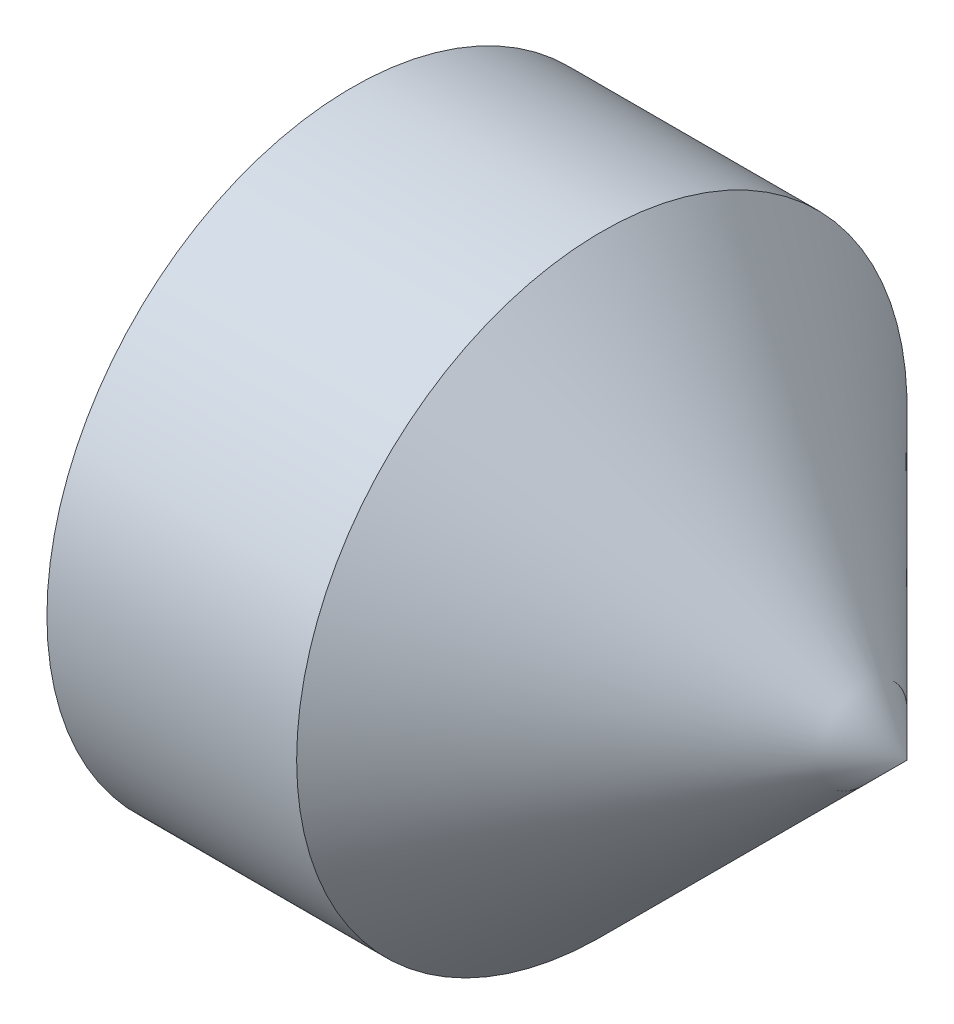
from build123d import *

# Parameters (mm, degrees)
HEX_2_DEPTH = 3


with BuildPart() as part:
    # BodySke → BaseBody (revolve)
    with BuildSketch(Plane.XY, mode=Mode.PRIVATE) as basebody_sk:
        Polygon((0, 0), (0, 2.055), (0.545596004, 3), (3, 3), (6, 0), align=None)
    revolve(basebody_sk.sketch.rotate(Axis((-12.7, 0, 0), (1, 0, 0)), 90), axis=Axis((-12.7, 0, 0), (1, 0, 0)))

    # Sketch2 → Hex 2 (cut)
    with BuildSketch(Plane.ZY):
        Polygon((0.721687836, 1.25), (-0.721687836, 1.25), (-1.443375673, 0), (-0.721687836, -1.25), (0.721687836, -1.25), (1.443375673, 0), align=None)
    extrude(amount=-HEX_2_DEPTH, mode=Mode.SUBTRACT)


solid = part.part
